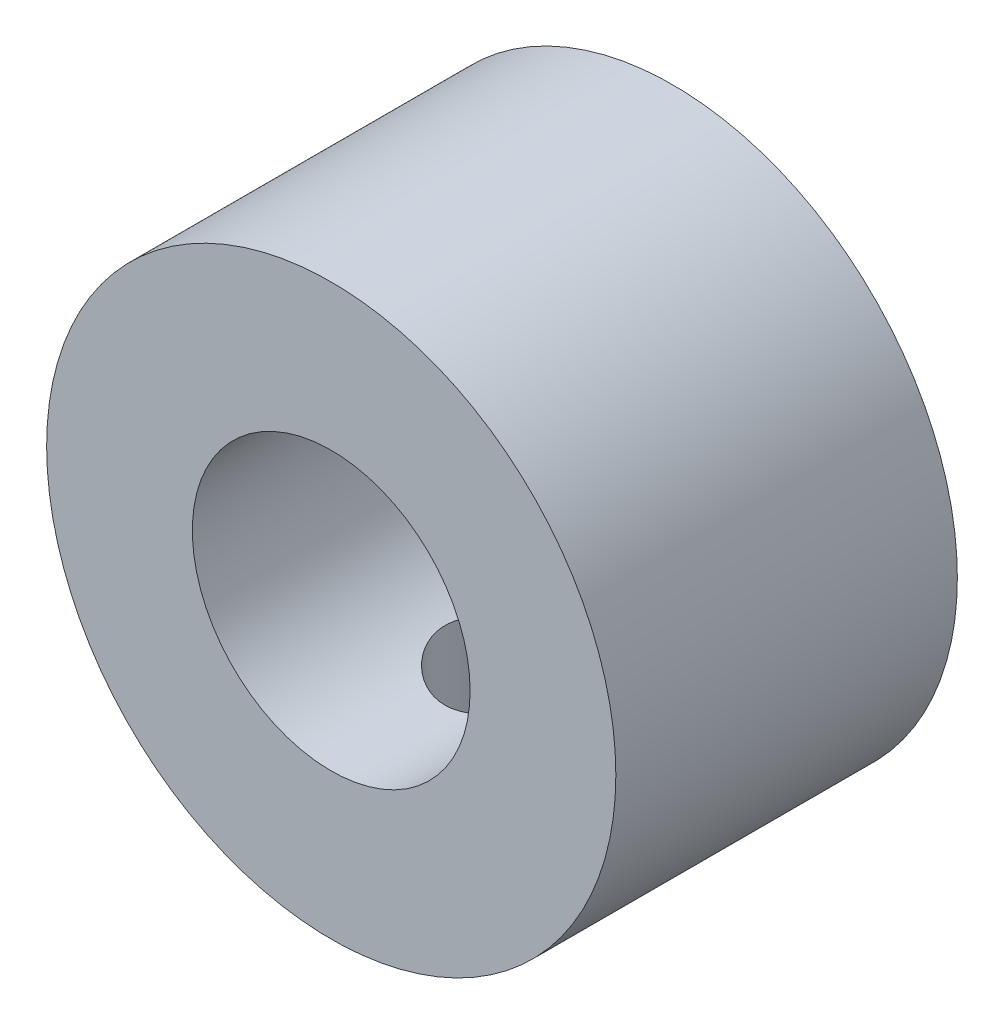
ISO-10303-21;
HEADER;
FILE_DESCRIPTION(('STEP AP214'),'2;1');
FILE_NAME('part.step','',(''),(''),'','','');
FILE_SCHEMA(('AUTOMOTIVE_DESIGN { 1 0 10303 214 1 1 1 1 }'));
ENDSEC;
DATA;
#1=APPLICATION_CONTEXT('core data for automotive mechanical design processes');
#2=APPLICATION_PROTOCOL_DEFINITION('international standard','automotive_design',2000,#1);
#3=PRODUCT_CONTEXT('',#1,'mechanical');
#4=PRODUCT('Part','Part','',(#3));
#5=PRODUCT_RELATED_PRODUCT_CATEGORY('part','',(#4));
#6=PRODUCT_DEFINITION_FORMATION('','',#4);
#7=PRODUCT_DEFINITION_CONTEXT('part definition',#1,'design');
#8=PRODUCT_DEFINITION('design','',#6,#7);
#9=PRODUCT_DEFINITION_SHAPE('','',#8);
#10=(LENGTH_UNIT() NAMED_UNIT(*) SI_UNIT(.MILLI.,.METRE.));
#11=(NAMED_UNIT(*) PLANE_ANGLE_UNIT() SI_UNIT($,.RADIAN.));
#12=(NAMED_UNIT(*) SI_UNIT($,.STERADIAN.) SOLID_ANGLE_UNIT());
#13=UNCERTAINTY_MEASURE_WITH_UNIT(LENGTH_MEASURE(1.E-05),#10,'distance_accuracy_value','');
#14=(GEOMETRIC_REPRESENTATION_CONTEXT(3) GLOBAL_UNCERTAINTY_ASSIGNED_CONTEXT((#13)) GLOBAL_UNIT_ASSIGNED_CONTEXT((#10,
#11,#12)) REPRESENTATION_CONTEXT('',''));
#15=CARTESIAN_POINT('',(0.,0.,0.));
#16=DIRECTION('',(0.,0.,1.));
#17=DIRECTION('',(1.,0.,0.));
#18=AXIS2_PLACEMENT_3D('',#15,#16,#17);
#19=CARTESIAN_POINT('',(0.,0.,7.49999999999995));
#20=DIRECTION('',(0.,0.,0.999999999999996));
#21=DIRECTION('',(1.,0.,0.));
#22=AXIS2_PLACEMENT_3D('',#19,#20,#21);
#23=PLANE('',#22);
#24=CARTESIAN_POINT('',(0.,0.,7.49999999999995));
#25=DIRECTION('',(0.,0.,0.999999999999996));
#26=DIRECTION('',(1.,0.,0.));
#27=AXIS2_PLACEMENT_3D('',#24,#25,#26);
#28=CIRCLE('',#27,12.5);
#29=CARTESIAN_POINT('',(12.5000000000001,0.,7.49999999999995));
#30=VERTEX_POINT('',#29);
#31=EDGE_CURVE('E12',#30,#30,#28,.T.);
#32=ORIENTED_EDGE('',*,*,#31,.T.);
#33=EDGE_LOOP('',(#32));
#34=FACE_BOUND('',#33,.T.);
#35=CARTESIAN_POINT('',(0.,0.,7.49999999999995));
#36=DIRECTION('',(0.,0.,0.999999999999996));
#37=DIRECTION('',(1.,0.,0.));
#38=AXIS2_PLACEMENT_3D('',#35,#36,#37);
#39=CIRCLE('',#38,6.1);
#40=CARTESIAN_POINT('',(6.10000000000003,0.,7.49999999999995));
#41=VERTEX_POINT('',#40);
#42=EDGE_CURVE('E143',#41,#41,#39,.T.);
#43=ORIENTED_EDGE('',*,*,#42,.F.);
#44=EDGE_LOOP('',(#43));
#45=FACE_BOUND('',#44,.T.);
#46=ADVANCED_FACE('F114',(#34,#45),#23,.T.);
#47=CARTESIAN_POINT('',(0.,0.,-7.49999999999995));
#48=DIRECTION('',(0.,0.,0.999999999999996));
#49=DIRECTION('',(1.,0.,0.));
#50=AXIS2_PLACEMENT_3D('',#47,#48,#49);
#51=PLANE('',#50);
#52=CARTESIAN_POINT('',(0.,0.,-7.49999999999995));
#53=DIRECTION('',(0.,0.,0.999999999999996));
#54=DIRECTION('',(1.,0.,0.));
#55=AXIS2_PLACEMENT_3D('',#52,#53,#54);
#56=CIRCLE('',#55,12.5);
#57=CARTESIAN_POINT('',(12.5000000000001,0.,-7.49999999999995));
#58=VERTEX_POINT('',#57);
#59=EDGE_CURVE('E124',#58,#58,#56,.T.);
#60=ORIENTED_EDGE('',*,*,#59,.F.);
#61=EDGE_LOOP('',(#60));
#62=FACE_BOUND('',#61,.T.);
#63=CARTESIAN_POINT('',(0.,0.,-7.49999999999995));
#64=DIRECTION('',(0.,0.,0.999999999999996));
#65=DIRECTION('',(1.,0.,0.));
#66=AXIS2_PLACEMENT_3D('',#63,#64,#65);
#67=CIRCLE('',#66,6.1);
#68=CARTESIAN_POINT('',(6.10000000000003,0.,-7.49999999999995));
#69=VERTEX_POINT('',#68);
#70=EDGE_CURVE('E140',#69,#69,#67,.T.);
#71=ORIENTED_EDGE('',*,*,#70,.T.);
#72=EDGE_LOOP('',(#71));
#73=FACE_BOUND('',#72,.T.);
#74=ADVANCED_FACE('F163',(#62,#73),#51,.F.);
#75=CARTESIAN_POINT('',(0.,0.,7.49999999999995));
#76=DIRECTION('',(0.,0.,-0.999999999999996));
#77=DIRECTION('',(-1.,0.,0.));
#78=AXIS2_PLACEMENT_3D('',#75,#76,#77);
#79=CYLINDRICAL_SURFACE('',#78,12.5);
#80=CARTESIAN_POINT('',(-5.10702591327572E-12,-12.5000000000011,-2.50000000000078));
#81=CARTESIAN_POINT('',(-0.13894226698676,-12.4999974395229,-2.49999488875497));
#82=CARTESIAN_POINT('',(-0.277949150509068,-12.4976596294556,-2.48837789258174));
#83=CARTESIAN_POINT('',(-0.552033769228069,-12.4885591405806,-2.44225374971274));
#84=CARTESIAN_POINT('',(-0.687108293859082,-12.4817929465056,-2.40772841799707));
#85=CARTESIAN_POINT('',(-0.949325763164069,-12.4645912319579,-2.31689681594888));
#86=CARTESIAN_POINT('',(-1.07647616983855,-12.4541592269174,-2.26061140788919));
#87=CARTESIAN_POINT('',(-1.31951997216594,-12.4307599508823,-2.1279193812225));
#88=CARTESIAN_POINT('',(-1.43541403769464,-12.4177928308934,-2.0515139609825));
#89=CARTESIAN_POINT('',(-1.65423369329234,-12.39055413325,-1.87965376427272));
#90=CARTESIAN_POINT('',(-1.75698487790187,-12.3762686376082,-1.78397911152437));
#91=CARTESIAN_POINT('',(-1.94509189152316,-12.3481045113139,-1.57676895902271));
#92=CARTESIAN_POINT('',(-2.0304463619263,-12.3342259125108,-1.46523222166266));
#93=CARTESIAN_POINT('',(-2.18207938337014,-12.3083110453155,-1.22820951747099));
#94=CARTESIAN_POINT('',(-2.24817734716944,-12.2962926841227,-1.10260589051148));
#95=CARTESIAN_POINT('',(-2.35826416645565,-12.2756567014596,-0.841795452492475));
#96=CARTESIAN_POINT('',(-2.40225520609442,-12.2670387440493,-0.706589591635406));
#97=CARTESIAN_POINT('',(-2.46631324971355,-12.2543201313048,-0.432289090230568));
#98=CARTESIAN_POINT('',(-2.48668624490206,-12.2501617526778,-0.293268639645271));
#99=CARTESIAN_POINT('',(-2.50388031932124,-12.2466593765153,-0.0137254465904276));
#100=CARTESIAN_POINT('',(-2.50070380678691,-12.2473148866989,0.126797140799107));
#101=CARTESIAN_POINT('',(-2.47113643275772,-12.2533137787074,0.403116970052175));
#102=CARTESIAN_POINT('',(-2.44509635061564,-12.2585863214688,0.538953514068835));
#103=CARTESIAN_POINT('',(-2.3710947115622,-12.2731136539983,0.804290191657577));
#104=CARTESIAN_POINT('',(-2.32313210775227,-12.2823686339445,0.933790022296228));
#105=CARTESIAN_POINT('',(-2.20631195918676,-12.3038904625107,1.18378815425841));
#106=CARTESIAN_POINT('',(-2.13731537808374,-12.3161772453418,1.30421969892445));
#107=CARTESIAN_POINT('',(-1.98048393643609,-12.342365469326,1.53192712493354));
#108=CARTESIAN_POINT('',(-1.89264691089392,-12.3562670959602,1.63920149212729));
#109=CARTESIAN_POINT('',(-1.69874983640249,-12.3844255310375,1.8395735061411));
#110=CARTESIAN_POINT('',(-1.59239040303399,-12.3986842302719,1.93238141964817));
#111=CARTESIAN_POINT('',(-1.36546256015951,-12.4257212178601,2.09888461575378));
#112=CARTESIAN_POINT('',(-1.24489396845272,-12.4384994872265,2.17257965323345));
#113=CARTESIAN_POINT('',(-0.992648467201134,-12.4611672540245,2.29881877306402));
#114=CARTESIAN_POINT('',(-0.860954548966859,-12.471052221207,2.3513297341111));
#115=CARTESIAN_POINT('',(-0.590372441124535,-12.4867852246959,2.43340118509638));
#116=CARTESIAN_POINT('',(-0.451485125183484,-12.4926337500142,2.46296445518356));
#117=CARTESIAN_POINT('',(-0.172948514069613,-12.4995667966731,2.49789113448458));
#118=CARTESIAN_POINT('',(-0.0333508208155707,-12.5007293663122,2.50365104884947));
#119=CARTESIAN_POINT('',(0.244812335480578,-12.4983762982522,2.49187535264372));
#120=CARTESIAN_POINT('',(0.383377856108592,-12.4948609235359,2.47434105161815));
#121=CARTESIAN_POINT('',(0.654264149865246,-12.4835958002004,2.41680406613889));
#122=CARTESIAN_POINT('',(0.786629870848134,-12.4758844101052,2.37700482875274));
#123=CARTESIAN_POINT('',(1.04280906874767,-12.457088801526,2.27629004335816));
#124=CARTESIAN_POINT('',(1.16662190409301,-12.4460043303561,2.21537291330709));
#125=CARTESIAN_POINT('',(1.40385293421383,-12.4214977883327,2.07329377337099));
#126=CARTESIAN_POINT('',(1.51712531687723,-12.4080487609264,1.99189304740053));
#127=CARTESIAN_POINT('',(1.72854504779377,-12.3803683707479,1.81147702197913));
#128=CARTESIAN_POINT('',(1.82669077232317,-12.3661369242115,1.71245983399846));
#129=CARTESIAN_POINT('',(2.00660147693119,-12.3382325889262,1.49781662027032));
#130=CARTESIAN_POINT('',(2.08809425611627,-12.3245715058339,1.38196063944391));
#131=CARTESIAN_POINT('',(2.23046355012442,-12.2996047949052,1.13797159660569));
#132=CARTESIAN_POINT('',(2.29134088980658,-12.2882990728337,1.00983902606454));
#133=CARTESIAN_POINT('',(2.3903796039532,-12.2694185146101,0.745579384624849));
#134=CARTESIAN_POINT('',(2.42865874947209,-12.2618243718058,0.609497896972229));
#135=CARTESIAN_POINT('',(2.48177162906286,-12.2511859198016,0.332666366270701));
#136=CARTESIAN_POINT('',(2.49660842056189,-12.248141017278,0.191916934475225));
#137=CARTESIAN_POINT('',(2.50230227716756,-12.2469787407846,-0.0875221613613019));
#138=CARTESIAN_POINT('',(2.4935894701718,-12.2487729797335,-0.226202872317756));
#139=CARTESIAN_POINT('',(2.45338076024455,-12.2568893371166,-0.500079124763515));
#140=CARTESIAN_POINT('',(2.42188504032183,-12.2632114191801,-0.63527469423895));
#141=CARTESIAN_POINT('',(2.33719642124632,-12.2796316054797,-0.898069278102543));
#142=CARTESIAN_POINT('',(2.28405626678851,-12.2897205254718,-1.02568590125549));
#143=CARTESIAN_POINT('',(2.15763661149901,-12.312542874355,-1.27025930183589));
#144=CARTESIAN_POINT('',(2.08435542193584,-12.3252765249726,-1.3872151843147));
#145=CARTESIAN_POINT('',(1.91826478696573,-12.3522240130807,-1.60928893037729));
#146=CARTESIAN_POINT('',(1.82514471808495,-12.366459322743,-1.71417191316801));
#147=CARTESIAN_POINT('',(1.62266092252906,-12.3946520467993,-1.90696551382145));
#148=CARTESIAN_POINT('',(1.51329346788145,-12.4086093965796,-1.9948722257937));
#149=CARTESIAN_POINT('',(1.28004407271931,-12.4348458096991,-2.15208660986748));
#150=CARTESIAN_POINT('',(1.15602221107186,-12.4471057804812,-2.22119000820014));
#151=CARTESIAN_POINT('',(0.897915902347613,-12.4683781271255,-2.33746530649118));
#152=CARTESIAN_POINT('',(0.76384065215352,-12.4773934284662,-2.38465697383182));
#153=CARTESIAN_POINT('',(0.524553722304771,-12.4894093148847,-2.44662987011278));
#154=CARTESIAN_POINT('',(0.420704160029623,-12.4933575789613,-2.4666079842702));
#155=CARTESIAN_POINT('',(0.211248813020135,-12.4986538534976,-2.49329478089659));
#156=CARTESIAN_POINT('',(0.105643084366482,-12.5000019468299,-2.50000388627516));
#157=CARTESIAN_POINT('',(-5.10702591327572E-12,-12.5000000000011,-2.50000000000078));
#158=B_SPLINE_CURVE_WITH_KNOTS('',3,(#80,#81,#82,#83,#84,#85,#86,#87,#88,#89,#90,#91,#92,#93,
#94,#95,#96,#97,#98,#99,#100,#101,#102,#103,#104,#105,#106,#107,#108,#109,#110,#111,#112,#113,
#114,#115,#116,#117,#118,#119,#120,#121,#122,#123,#124,#125,#126,#127,#128,#129,#130,#131,#132,
#133,#134,#135,#136,#137,#138,#139,#140,#141,#142,#143,#144,#145,#146,#147,#148,#149,#150,#151,
#152,#153,#154,#155,#156,#157),.UNSPECIFIED.,.T.,.F.,(4,2,2,2,2,2,2,2,2,2,2,2,2,2,2,2,2,2,2,2,2,
2,2,2,2,2,2,2,2,2,2,2,2,2,2,2,2,2,4),(0.,0.416440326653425,0.833211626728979,1.24958433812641,
1.66593225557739,2.08733167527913,2.50876399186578,2.93402987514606,3.35925373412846,
3.77890462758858,4.1985126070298,4.61179317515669,5.02509348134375,5.44118725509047,
5.85732886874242,6.28095631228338,6.70458918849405,7.12888187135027,7.55312314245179,
7.97026839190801,8.38739019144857,8.80076134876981,9.21416348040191,9.63262665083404,
10.0511347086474,10.4760157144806,10.9008797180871,11.3235095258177,11.7460842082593,
12.1609930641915,12.5758985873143,12.9897990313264,13.4037341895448,13.8247019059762,
14.2457663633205,14.6712374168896,15.0963238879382,15.4129693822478,15.7296047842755),.UNSPECIFIED.);
#159=CARTESIAN_POINT('',(-1.11022302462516E-12,-12.5,2.49999999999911));
#160=VERTEX_POINT('',#159);
#161=CARTESIAN_POINT('',(-5.10702591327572E-12,-12.5000000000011,-2.50000000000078));
#162=VERTEX_POINT('',#161);
#163=EDGE_CURVE('E132',#160,#162,#158,.T.);
#164=ORIENTED_EDGE('',*,*,#163,.T.);
#165=EDGE_CURVE('E130',#162,#160,#158,.T.);
#166=ORIENTED_EDGE('',*,*,#165,.T.);
#167=EDGE_LOOP('',(#164,#166));
#168=FACE_BOUND('',#167,.T.);
#169=ORIENTED_EDGE('',*,*,#31,.F.);
#170=EDGE_LOOP('',(#169));
#171=FACE_BOUND('',#170,.T.);
#172=ORIENTED_EDGE('',*,*,#59,.T.);
#173=EDGE_LOOP('',(#172));
#174=FACE_BOUND('',#173,.T.);
#175=ADVANCED_FACE('F116',(#168,#171,#174),#79,.T.);
#176=CARTESIAN_POINT('',(0.,0.,7.49999999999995));
#177=DIRECTION('',(0.,0.,-0.999999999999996));
#178=DIRECTION('',(-1.,0.,0.));
#179=AXIS2_PLACEMENT_3D('',#176,#177,#178);
#180=CYLINDRICAL_SURFACE('',#179,6.1);
#181=CARTESIAN_POINT('',(-3.99680288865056E-12,-6.10000000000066,-2.49999999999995));
#182=CARTESIAN_POINT('',(-0.134111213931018,-6.0999926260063,-2.4999901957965));
#183=CARTESIAN_POINT('',(-0.268426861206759,-6.0955270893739,-2.48914681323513));
#184=CARTESIAN_POINT('',(-0.53326818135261,-6.07810365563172,-2.44616325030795));
#185=CARTESIAN_POINT('',(-0.663782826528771,-6.06512320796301,-2.41396651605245));
#186=CARTESIAN_POINT('',(-0.916749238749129,-6.03206318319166,-2.32965221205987));
#187=CARTESIAN_POINT('',(-1.03922636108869,-6.01200734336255,-2.27760120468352));
#188=CARTESIAN_POINT('',(-1.27359533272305,-5.9667595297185,-2.15532737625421));
#189=CARTESIAN_POINT('',(-1.38549056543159,-5.94156920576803,-2.0851103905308));
#190=CARTESIAN_POINT('',(-1.60116541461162,-5.88720545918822,-1.92486721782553));
#191=CARTESIAN_POINT('',(-1.70435925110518,-5.85790437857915,-1.83409628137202));
#192=CARTESIAN_POINT('',(-1.89455959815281,-5.79918715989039,-1.63689538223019));
#193=CARTESIAN_POINT('',(-1.98155783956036,-5.76977097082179,-1.53045746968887));
#194=CARTESIAN_POINT('',(-2.14095272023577,-5.71260348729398,-1.29884417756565));
#195=CARTESIAN_POINT('',(-2.21246544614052,-5.68499648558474,-1.17302117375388));
#196=CARTESIAN_POINT('',(-2.33305019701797,-5.63658854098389,-0.909834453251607));
#197=CARTESIAN_POINT('',(-2.38213340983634,-5.61578420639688,-0.772476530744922));
#198=CARTESIAN_POINT('',(-2.45406739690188,-5.58471415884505,-0.496857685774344));
#199=CARTESIAN_POINT('',(-2.47804323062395,-5.57399886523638,-0.358942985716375));
#200=CARTESIAN_POINT('',(-2.50259387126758,-5.56302291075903,-0.0806637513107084));
#201=CARTESIAN_POINT('',(-2.50318099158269,-5.56275674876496,0.0596994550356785));
#202=CARTESIAN_POINT('',(-2.48178707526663,-5.5723273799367,0.327851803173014));
#203=CARTESIAN_POINT('',(-2.46146628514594,-5.58142095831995,0.455805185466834));
#204=CARTESIAN_POINT('',(-2.40161135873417,-5.6074340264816,0.706294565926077));
#205=CARTESIAN_POINT('',(-2.36207368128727,-5.62435495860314,0.828829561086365));
#206=CARTESIAN_POINT('',(-2.2641431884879,-5.66449431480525,1.06804286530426));
#207=CARTESIAN_POINT('',(-2.20537295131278,-5.68783716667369,1.18454484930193));
#208=CARTESIAN_POINT('',(-2.07091163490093,-5.73815907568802,1.40647621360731));
#209=CARTESIAN_POINT('',(-1.99521400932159,-5.7651395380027,1.51190128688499));
#210=CARTESIAN_POINT('',(-1.82179958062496,-5.82237338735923,1.71772987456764));
#211=CARTESIAN_POINT('',(-1.72279092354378,-5.85271429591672,1.81702365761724));
#212=CARTESIAN_POINT('',(-1.50921686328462,-5.91138897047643,1.99796332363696));
#213=CARTESIAN_POINT('',(-1.39464805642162,-5.93972229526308,2.07960533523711));
#214=CARTESIAN_POINT('',(-1.14992685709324,-5.99196428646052,2.22447961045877));
#215=CARTESIAN_POINT('',(-1.0194905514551,-6.01576375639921,2.28727456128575));
#216=CARTESIAN_POINT('',(-0.748681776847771,-6.05542370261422,2.38964393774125));
#217=CARTESIAN_POINT('',(-0.608314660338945,-6.07128841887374,2.42923076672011));
#218=CARTESIAN_POINT('',(-0.330914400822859,-6.09250727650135,2.48177000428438));
#219=CARTESIAN_POINT('',(-0.194208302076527,-6.09844853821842,2.49621254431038));
#220=CARTESIAN_POINT('',(0.0797911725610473,-6.10101492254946,2.50247815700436));
#221=CARTESIAN_POINT('',(0.217084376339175,-6.09764261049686,2.49430745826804));
#222=CARTESIAN_POINT('',(0.481475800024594,-6.08234313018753,2.45665756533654));
#223=CARTESIAN_POINT('',(0.608748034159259,-6.07083140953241,2.42821265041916));
#224=CARTESIAN_POINT('',(0.856583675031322,-6.04084902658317,2.35224789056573));
#225=CARTESIAN_POINT('',(0.977146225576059,-6.02237747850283,2.30472561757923));
#226=CARTESIAN_POINT('',(1.21233977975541,-5.97954590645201,2.19040143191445));
#227=CARTESIAN_POINT('',(1.32667235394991,-5.9550215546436,2.12304911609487));
#228=CARTESIAN_POINT('',(1.54281916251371,-5.90271931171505,1.9715837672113));
#229=CARTESIAN_POINT('',(1.64462822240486,-5.87494008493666,1.88746384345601));
#230=CARTESIAN_POINT('',(1.84024017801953,-5.81675523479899,1.69803119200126));
#231=CARTESIAN_POINT('',(1.93300091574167,-5.78630092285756,1.59165448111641));
#232=CARTESIAN_POINT('',(2.09963095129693,-5.72794591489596,1.36433608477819));
#233=CARTESIAN_POINT('',(2.17349646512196,-5.70004573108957,1.24339148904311));
#234=CARTESIAN_POINT('',(2.30089454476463,-5.64983648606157,0.98816128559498));
#235=CARTESIAN_POINT('',(2.35416607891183,-5.62760034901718,0.853729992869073));
#236=CARTESIAN_POINT('',(2.43687995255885,-5.59228725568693,0.576611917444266));
#237=CARTESIAN_POINT('',(2.46634108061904,-5.5792030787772,0.433931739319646));
#238=CARTESIAN_POINT('',(2.49876005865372,-5.56475373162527,0.155888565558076));
#239=CARTESIAN_POINT('',(2.50353869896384,-5.56258378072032,0.0207785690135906));
#240=CARTESIAN_POINT('',(2.49128516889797,-5.56808262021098,-0.248230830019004));
#241=CARTESIAN_POINT('',(2.47425609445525,-5.57575001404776,-0.382130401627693));
#242=CARTESIAN_POINT('',(2.42038283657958,-5.59933449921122,-0.638919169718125));
#243=CARTESIAN_POINT('',(2.3844345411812,-5.6148775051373,-0.762033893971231));
#244=CARTESIAN_POINT('',(2.29460352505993,-5.65218079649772,-1.00052185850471));
#245=CARTESIAN_POINT('',(2.24071579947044,-5.67394281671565,-1.11589292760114));
#246=CARTESIAN_POINT('',(2.11286888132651,-5.72282488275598,-1.34304106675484));
#247=CARTESIAN_POINT('',(2.03791320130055,-5.75018526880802,-1.45420466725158));
#248=CARTESIAN_POINT('',(1.87148160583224,-5.80648519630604,-1.66294663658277));
#249=CARTESIAN_POINT('',(1.78000026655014,-5.8354252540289,-1.76052052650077));
#250=CARTESIAN_POINT('',(1.57554744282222,-5.89403964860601,-1.94628178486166));
#251=CARTESIAN_POINT('',(1.46152441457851,-5.92362528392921,-2.0333458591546));
#252=CARTESIAN_POINT('',(1.21941603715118,-5.97816274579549,-2.18714680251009));
#253=CARTESIAN_POINT('',(1.09132427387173,-6.00311244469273,-2.25387434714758));
#254=CARTESIAN_POINT('',(0.826687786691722,-6.04517532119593,-2.36361826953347));
#255=CARTESIAN_POINT('',(0.690329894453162,-6.06241782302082,-2.40702862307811));
#256=CARTESIAN_POINT('',(0.481490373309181,-6.08137254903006,-2.45423648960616));
#257=CARTESIAN_POINT('',(0.411224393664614,-6.0865377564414,-2.46698443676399));
#258=CARTESIAN_POINT('',(0.269736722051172,-6.09444299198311,-2.48642771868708));
#259=CARTESIAN_POINT('',(0.198515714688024,-6.09718467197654,-2.49312717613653));
#260=CARTESIAN_POINT('',(0.0848048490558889,-6.09955878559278,-2.49892269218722));
#261=CARTESIAN_POINT('',(0.0424126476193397,-6.10000233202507,-2.50000310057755));
#262=CARTESIAN_POINT('',(-3.99680288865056E-12,-6.10000000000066,-2.49999999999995));
#263=B_SPLINE_CURVE_WITH_KNOTS('',3,(#181,#182,#183,#184,#185,#186,#187,#188,#189,#190,#191,
#192,#193,#194,#195,#196,#197,#198,#199,#200,#201,#202,#203,#204,#205,#206,#207,#208,#209,#210,
#211,#212,#213,#214,#215,#216,#217,#218,#219,#220,#221,#222,#223,#224,#225,#226,#227,#228,#229,
#230,#231,#232,#233,#234,#235,#236,#237,#238,#239,#240,#241,#242,#243,#244,#245,#246,#247,#248,
#249,#250,#251,#252,#253,#254,#255,#256,#257,#258,#259,#260,#261,#262),.UNSPECIFIED.,.T.,.F.,(4,
2,2,2,2,2,2,2,2,2,2,2,2,2,2,2,2,2,2,2,2,2,2,2,2,2,2,2,2,2,2,2,2,2,2,2,2,2,2,2,4),(0.,
0.402188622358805,0.805446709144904,1.20736457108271,1.6091534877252,2.02888984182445,
2.44883992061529,2.88862819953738,3.32819687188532,3.74709443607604,4.1657714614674,
4.55358896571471,4.94147796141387,5.33748781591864,5.73365108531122,6.16210548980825,
6.59065376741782,7.02848937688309,7.46609077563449,7.87674265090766,8.28728142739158,
8.67825101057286,9.06927036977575,9.47237311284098,9.87564185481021,10.3068278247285,
10.7381000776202,11.1746723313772,11.6108997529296,12.014434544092,12.4179120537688,
12.8038059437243,13.1898075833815,13.5985792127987,14.0074852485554,14.4448035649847,
14.8823220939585,15.3121949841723,15.5267506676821,15.7411599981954,15.8683520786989),.UNSPECIFIED.);
#264=CARTESIAN_POINT('',(-3.99680288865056E-12,-6.10000000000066,-2.49999999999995));
#265=VERTEX_POINT('',#264);
#266=EDGE_CURVE('E136',#265,#265,#263,.T.);
#267=ORIENTED_EDGE('',*,*,#266,.F.);
#268=EDGE_LOOP('',(#267));
#269=FACE_BOUND('',#268,.T.);
#270=ORIENTED_EDGE('',*,*,#42,.T.);
#271=EDGE_LOOP('',(#270));
#272=FACE_BOUND('',#271,.T.);
#273=ORIENTED_EDGE('',*,*,#70,.F.);
#274=EDGE_LOOP('',(#273));
#275=FACE_BOUND('',#274,.T.);
#276=ADVANCED_FACE('F155',(#269,#272,#275),#180,.F.);
#277=CARTESIAN_POINT('',(-5.55111512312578E-12,-12.5000000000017,-8.32667268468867E-13));
#278=DIRECTION('',(0.,-1.,0.));
#279=DIRECTION('',(0.,0.,-0.999999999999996));
#280=AXIS2_PLACEMENT_3D('',#277,#278,#279);
#281=CYLINDRICAL_SURFACE('',#280,2.49999999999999);
#282=ORIENTED_EDGE('',*,*,#266,.T.);
#283=EDGE_LOOP('',(#282));
#284=FACE_BOUND('',#283,.T.);
#285=ORIENTED_EDGE('',*,*,#163,.F.);
#286=ORIENTED_EDGE('',*,*,#165,.F.);
#287=EDGE_LOOP('',(#285,#286));
#288=FACE_BOUND('',#287,.T.);
#289=ADVANCED_FACE('F133',(#284,#288),#281,.F.);
#290=CLOSED_SHELL('',(#46,#74,#175,#276,#289));
#291=MANIFOLD_SOLID_BREP('B2',#290);
#292=ADVANCED_BREP_SHAPE_REPRESENTATION('',(#18,#291),#14);
#293=SHAPE_DEFINITION_REPRESENTATION(#9,#292);
ENDSEC;
END-ISO-10303-21;
